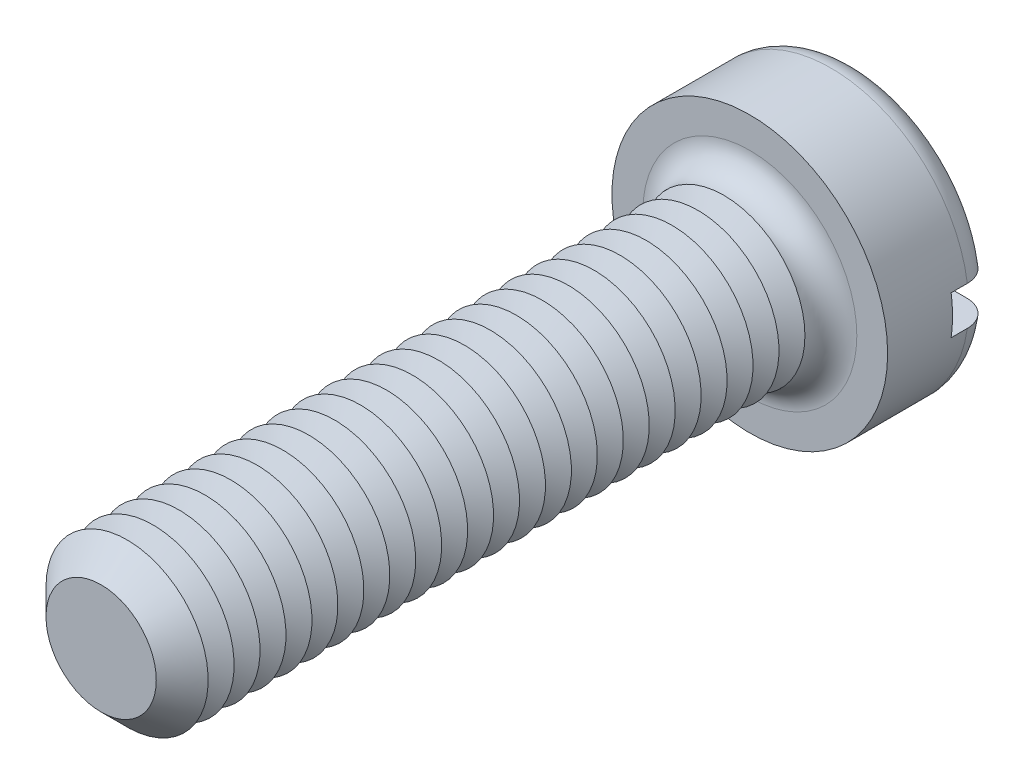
from build123d import *

# Parameters (mm, degrees)
SKETCH3_R           = 4.25
BOSS_EXTRUDE2_DEPTH = 3.3
SKETCH4_R           = 2.5
BOSS_EXTRUDE3_DEPTH = 20
FILLET1_R           = 0.8
CHAMFER1_SIZE       = 0.8
LPATTERN1_COUNT     = 23
LPATTERN1_PITCH     = 0.8
SKETCH8_W           = 8.5
SKETCH8_H           = 1.2
CUT_EXTRUDE1_DEPTH  = 1.3


with BuildPart() as part:
    # Sketch3 → Boss-Extrude2 (new body)
    with BuildSketch(Plane.XY):
        Circle(SKETCH3_R)
    extrude(amount=-BOSS_EXTRUDE2_DEPTH)

    # Sketch4 → Boss-Extrude3 (add)
    with BuildSketch(Plane.XY):
        Circle(SKETCH4_R)
    extrude(amount=BOSS_EXTRUDE3_DEPTH)

    # Fillet1
    fillet1_edges = [part.edges().sort_by_distance(p)[0] for p in [
        (-4.25, 0, -3.3),
        (-2.5, 0, 0),
    ]]
    fillet(fillet1_edges, radius=FILLET1_R)

    # Chamfer1
    chamfer1_edges = [part.edges().sort_by_distance(p)[0] for p in [
        (-2.5, 0, 20),
    ]]
    chamfer(chamfer1_edges, length=CHAMFER1_SIZE)

    # Sketch6 → Cut-Revolve1 (revolve, cut)
    with BuildSketch(Plane(origin=(0, 0, 0), x_dir=(0, 0, -1), z_dir=(1, 0, 0)), mode=Mode.PRIVATE) as cut_revolve1_sk:
        Polygon((-0.8, 2.5), (-1.2, 1.807179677), (-1.6, 2.5), align=None)
    cut_revolve1 = revolve(cut_revolve1_sk.sketch.rotate(Axis((0, 0, -1.694361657), (0, 0, 1)), 90), axis=Axis((0, 0, -1.694361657), (0, 0, 1)), mode=Mode.SUBTRACT)

    # LPattern1: Cut-Revolve1 ×23
    with Locations(*[(0, 0, i * LPATTERN1_PITCH) for i in range(1, LPATTERN1_COUNT)]):
        add(cut_revolve1, mode=Mode.SUBTRACT)

    # Sketch8 → Cut-Extrude1 (cut)
    with BuildSketch(Plane(origin=(0, 0, -3.3), x_dir=(-1, 0, 0), z_dir=(0, 0, -1))):
        Rectangle(SKETCH8_W, SKETCH8_H)
    extrude(amount=-CUT_EXTRUDE1_DEPTH, mode=Mode.SUBTRACT)


solid = part.part
